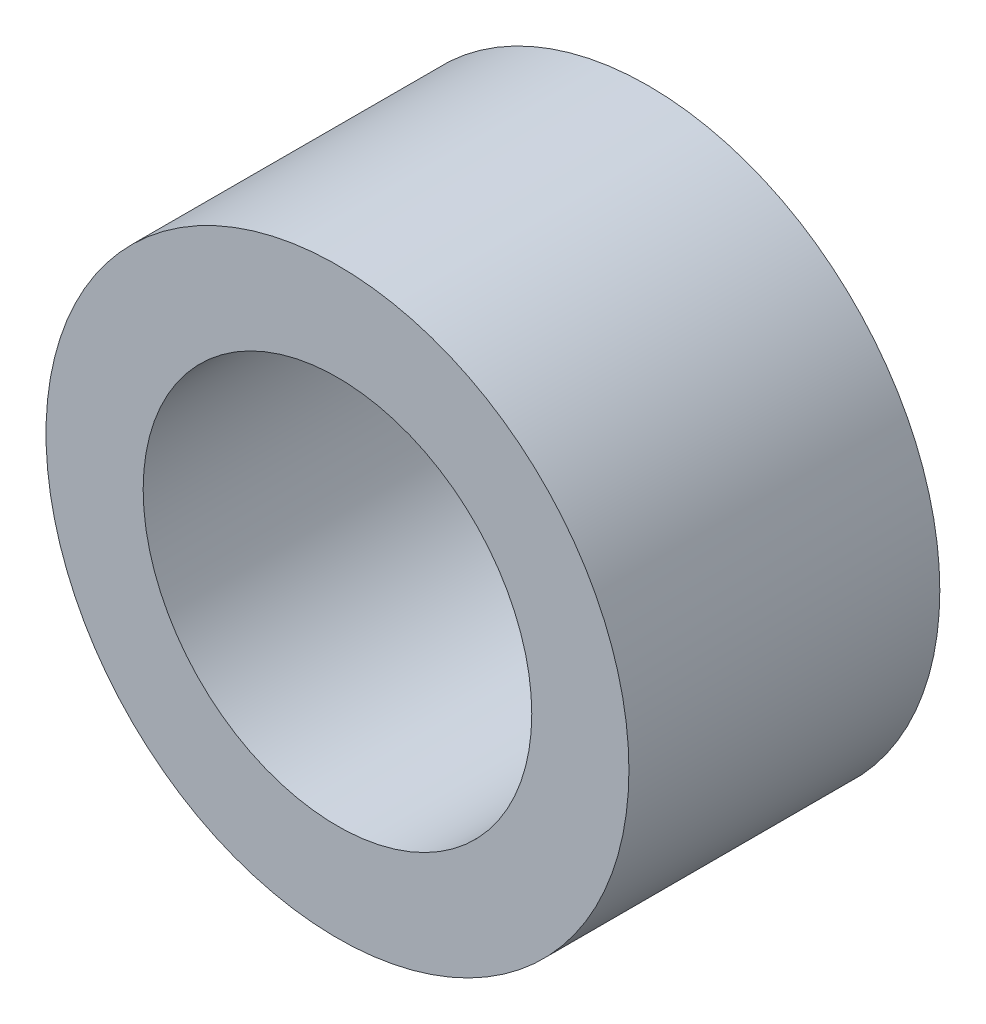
from build123d import *

# Parameters (mm, degrees)
ESQUISSE1_R          = 15
ESQUISSE1_R_2        = 10
BASE_EXTRUSION_DEPTH = 16


with BuildPart() as part:
    # Esquisse1 → Base-Extrusion (new body)
    with BuildSketch(Plane.XY):
        Circle(ESQUISSE1_R)
        Circle(ESQUISSE1_R_2, mode=Mode.SUBTRACT)
    extrude(amount=-BASE_EXTRUSION_DEPTH)


solid = part.part
